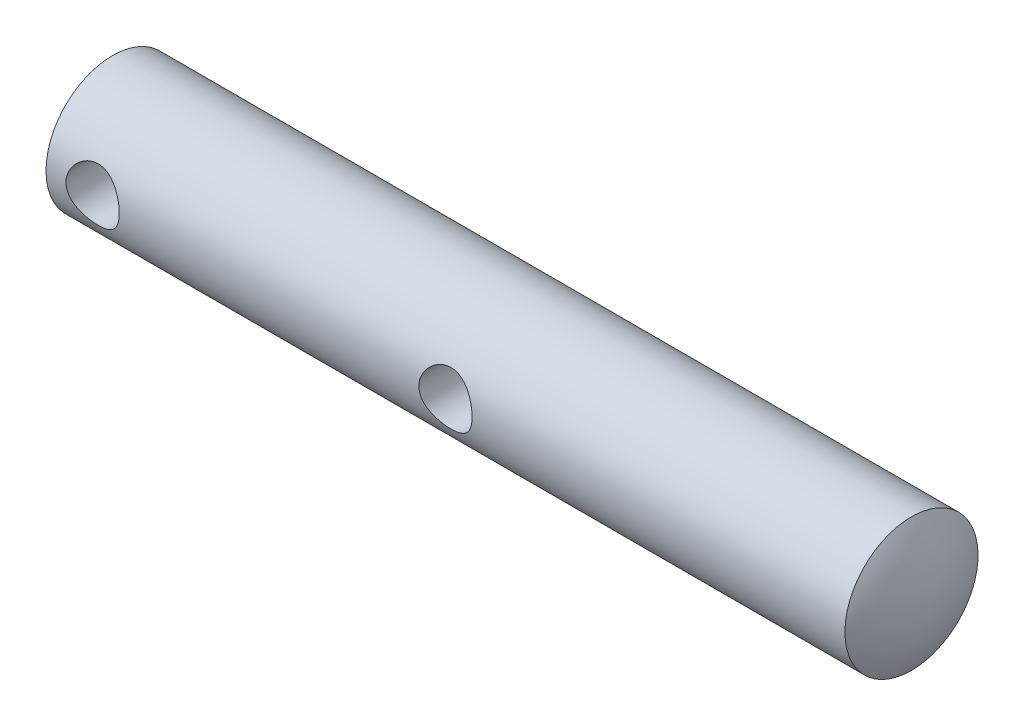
ISO-10303-21;
HEADER;
FILE_DESCRIPTION(('STEP AP214'),'2;1');
FILE_NAME('part.step','',(''),(''),'','','');
FILE_SCHEMA(('AUTOMOTIVE_DESIGN { 1 0 10303 214 1 1 1 1 }'));
ENDSEC;
DATA;
#1=APPLICATION_CONTEXT('core data for automotive mechanical design processes');
#2=APPLICATION_PROTOCOL_DEFINITION('international standard','automotive_design',2000,#1);
#3=PRODUCT_CONTEXT('',#1,'mechanical');
#4=PRODUCT('Part','Part','',(#3));
#5=PRODUCT_RELATED_PRODUCT_CATEGORY('part','',(#4));
#6=PRODUCT_DEFINITION_FORMATION('','',#4);
#7=PRODUCT_DEFINITION_CONTEXT('part definition',#1,'design');
#8=PRODUCT_DEFINITION('design','',#6,#7);
#9=PRODUCT_DEFINITION_SHAPE('','',#8);
#10=(LENGTH_UNIT() NAMED_UNIT(*) SI_UNIT(.MILLI.,.METRE.));
#11=(NAMED_UNIT(*) PLANE_ANGLE_UNIT() SI_UNIT($,.RADIAN.));
#12=(NAMED_UNIT(*) SI_UNIT($,.STERADIAN.) SOLID_ANGLE_UNIT());
#13=UNCERTAINTY_MEASURE_WITH_UNIT(LENGTH_MEASURE(1.E-05),#10,'distance_accuracy_value','');
#14=(GEOMETRIC_REPRESENTATION_CONTEXT(3) GLOBAL_UNCERTAINTY_ASSIGNED_CONTEXT((#13)) GLOBAL_UNIT_ASSIGNED_CONTEXT((#10,
#11,#12)) REPRESENTATION_CONTEXT('',''));
#15=CARTESIAN_POINT('',(0.,0.,0.));
#16=DIRECTION('',(0.,0.,1.));
#17=DIRECTION('',(1.,0.,0.));
#18=AXIS2_PLACEMENT_3D('',#15,#16,#17);
#19=CARTESIAN_POINT('',(52.861541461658,0.,0.));
#20=DIRECTION('',(-1.,0.,0.));
#21=DIRECTION('',(0.,-1.,0.));
#22=AXIS2_PLACEMENT_3D('',#19,#20,#21);
#23=SPHERICAL_SURFACE('',#22,9.86154146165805);
#24=CARTESIAN_POINT('',(61.361541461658,0.,0.));
#25=DIRECTION('',(-1.,0.,0.));
#26=DIRECTION('',(0.,0.,1.));
#27=AXIS2_PLACEMENT_3D('',#24,#25,#26);
#28=CIRCLE('',#27,5.);
#29=CARTESIAN_POINT('',(61.361541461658,0.,5.));
#30=VERTEX_POINT('',#29);
#31=EDGE_CURVE('E49',#30,#30,#28,.T.);
#32=ORIENTED_EDGE('',*,*,#31,.F.);
#33=EDGE_LOOP('',(#32));
#34=FACE_BOUND('',#33,.T.);
#35=ADVANCED_FACE('F14',(#34),#23,.T.);
#36=CARTESIAN_POINT('',(1.36154146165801,0.,0.));
#37=DIRECTION('',(-1.,0.,0.));
#38=DIRECTION('',(0.,0.,1.));
#39=AXIS2_PLACEMENT_3D('',#36,#37,#38);
#40=CYLINDRICAL_SURFACE('',#39,5.);
#41=CARTESIAN_POINT('',(33.361541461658,0.,5.));
#42=CARTESIAN_POINT('',(33.3615316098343,0.107493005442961,4.99999271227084));
#43=CARTESIAN_POINT('',(33.3528237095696,0.215172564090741,4.99649294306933));
#44=CARTESIAN_POINT('',(33.3182937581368,0.427496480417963,4.98283453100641));
#45=CARTESIAN_POINT('',(33.2924251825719,0.532131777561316,4.97265778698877));
#46=CARTESIAN_POINT('',(33.2246653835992,0.734953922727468,4.94674209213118));
#47=CARTESIAN_POINT('',(33.1828266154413,0.833160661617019,4.93102136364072));
#48=CARTESIAN_POINT('',(33.0845222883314,1.02107197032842,4.89556610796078));
#49=CARTESIAN_POINT('',(33.0280618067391,1.11077947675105,4.87583297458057));
#50=CARTESIAN_POINT('',(32.899305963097,1.28350100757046,4.83330886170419));
#51=CARTESIAN_POINT('',(32.8264348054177,1.36606227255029,4.81042296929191));
#52=CARTESIAN_POINT('',(32.6681414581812,1.51817500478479,4.76460576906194));
#53=CARTESIAN_POINT('',(32.5827131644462,1.58772010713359,4.74167444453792));
#54=CARTESIAN_POINT('',(32.3971133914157,1.71487456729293,4.69722791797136));
#55=CARTESIAN_POINT('',(32.2964549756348,1.77181498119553,4.67582115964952));
#56=CARTESIAN_POINT('',(32.086005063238,1.86775471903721,4.63833647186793));
#57=CARTESIAN_POINT('',(31.9762179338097,1.90676256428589,4.62225601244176));
#58=CARTESIAN_POINT('',(31.7558291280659,1.96389882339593,4.59826357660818));
#59=CARTESIAN_POINT('',(31.6454902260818,1.98289396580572,4.59001420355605));
#60=CARTESIAN_POINT('',(31.4229064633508,2.00217296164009,4.58164004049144));
#61=CARTESIAN_POINT('',(31.310662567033,2.00246601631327,4.58151125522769));
#62=CARTESIAN_POINT('',(31.0957847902,1.9849893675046,4.58910500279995));
#63=CARTESIAN_POINT('',(30.993025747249,1.96847531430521,4.5962817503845));
#64=CARTESIAN_POINT('',(30.7918819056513,1.91994688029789,4.61676187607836));
#65=CARTESIAN_POINT('',(30.6934978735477,1.88792979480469,4.63006632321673));
#66=CARTESIAN_POINT('',(30.501523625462,1.80869473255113,4.6615948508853));
#67=CARTESIAN_POINT('',(30.4080722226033,1.76117986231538,4.67991379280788));
#68=CARTESIAN_POINT('',(30.2301256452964,1.65250646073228,4.7193811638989));
#69=CARTESIAN_POINT('',(30.1456338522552,1.5913428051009,4.74053065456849));
#70=CARTESIAN_POINT('',(29.981131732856,1.4515505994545,4.78526736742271));
#71=CARTESIAN_POINT('',(29.901972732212,1.37193746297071,4.80891664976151));
#72=CARTESIAN_POINT('',(29.757856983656,1.20031442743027,4.85459824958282));
#73=CARTESIAN_POINT('',(29.6929030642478,1.10830206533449,4.87663024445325));
#74=CARTESIAN_POINT('',(29.5779240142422,0.912077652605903,4.91714681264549));
#75=CARTESIAN_POINT('',(29.528219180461,0.807660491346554,4.93555270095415));
#76=CARTESIAN_POINT('',(29.4473736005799,0.591023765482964,4.96614828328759));
#77=CARTESIAN_POINT('',(29.4162234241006,0.478808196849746,4.97834113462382));
#78=CARTESIAN_POINT('',(29.3750931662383,0.256895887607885,4.9945613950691));
#79=CARTESIAN_POINT('',(29.3639690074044,0.147443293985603,4.99902945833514));
#80=CARTESIAN_POINT('',(29.3598283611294,-0.0718453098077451,5.00068478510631));
#81=CARTESIAN_POINT('',(29.3668071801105,-0.181681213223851,4.99787393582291));
#82=CARTESIAN_POINT('',(29.39783321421,-0.39343273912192,4.98557567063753));
#83=CARTESIAN_POINT('',(29.421099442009,-0.495482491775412,4.97639391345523));
#84=CARTESIAN_POINT('',(29.4829771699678,-0.694135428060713,4.952594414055));
#85=CARTESIAN_POINT('',(29.5215906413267,-0.790737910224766,4.93797597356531));
#86=CARTESIAN_POINT('',(29.614326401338,-0.97907878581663,4.90416594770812));
#87=CARTESIAN_POINT('',(29.6688869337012,-1.07057802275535,4.88484815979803));
#88=CARTESIAN_POINT('',(29.7914817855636,-1.2434435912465,4.84373364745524));
#89=CARTESIAN_POINT('',(29.8595215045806,-1.32480584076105,4.82193593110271));
#90=CARTESIAN_POINT('',(30.0124114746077,-1.48072304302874,4.77645117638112));
#91=CARTESIAN_POINT('',(30.0980750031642,-1.55447393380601,4.75273441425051));
#92=CARTESIAN_POINT('',(30.2809815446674,-1.68675119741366,4.70741672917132));
#93=CARTESIAN_POINT('',(30.378226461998,-1.74527506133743,4.68581615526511));
#94=CARTESIAN_POINT('',(30.5830031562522,-1.84580750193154,4.64714299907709));
#95=CARTESIAN_POINT('',(30.6906254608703,-1.88765059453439,4.63011630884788));
#96=CARTESIAN_POINT('',(30.9122751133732,-1.95229621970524,4.60323673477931));
#97=CARTESIAN_POINT('',(31.0262976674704,-1.97511280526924,4.59337855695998));
#98=CARTESIAN_POINT('',(31.2486693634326,-1.99971561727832,4.58271759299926));
#99=CARTESIAN_POINT('',(31.3568363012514,-2.0028970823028,4.58131421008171));
#100=CARTESIAN_POINT('',(31.5720863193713,-1.99180315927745,4.58614836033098));
#101=CARTESIAN_POINT('',(31.6791695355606,-1.9775299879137,4.59238492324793));
#102=CARTESIAN_POINT('',(31.8848736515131,-1.93307136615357,4.61126649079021));
#103=CARTESIAN_POINT('',(31.983661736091,-1.9035374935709,4.62364831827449));
#104=CARTESIAN_POINT('',(32.1749200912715,-1.83000544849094,4.65324001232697));
#105=CARTESIAN_POINT('',(32.2673886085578,-1.78600328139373,4.67045121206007));
#106=CARTESIAN_POINT('',(32.4491510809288,-1.68187276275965,4.70898609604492));
#107=CARTESIAN_POINT('',(32.5379601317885,-1.62096533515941,4.73048882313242));
#108=CARTESIAN_POINT('',(32.7045347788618,-1.48589211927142,4.77463804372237));
#109=CARTESIAN_POINT('',(32.7822970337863,-1.41172233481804,4.79728488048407));
#110=CARTESIAN_POINT('',(32.9297443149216,-1.24650550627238,4.84293567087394));
#111=CARTESIAN_POINT('',(32.9985787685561,-1.15467600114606,4.86586757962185));
#112=CARTESIAN_POINT('',(33.1198785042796,-0.959900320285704,4.90800406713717));
#113=CARTESIAN_POINT('',(33.1723361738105,-0.85694900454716,4.92720691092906));
#114=CARTESIAN_POINT('',(33.2581636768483,-0.644738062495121,4.95939714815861));
#115=CARTESIAN_POINT('',(33.2918707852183,-0.535631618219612,4.97249363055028));
#116=CARTESIAN_POINT('',(33.3401805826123,-0.312876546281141,4.99144306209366));
#117=CARTESIAN_POINT('',(33.3548438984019,-0.199243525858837,4.99731899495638));
#118=CARTESIAN_POINT('',(33.3609368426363,-0.0569122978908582,4.99975899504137));
#119=CARTESIAN_POINT('',(33.3615440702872,-0.0284626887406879,5.00000192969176));
#120=CARTESIAN_POINT('',(33.361541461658,0.,5.));
#121=B_SPLINE_CURVE_WITH_KNOTS('',3,(#41,#42,#43,#44,#45,#46,#47,#48,#49,#50,#51,#52,#53,#54,
#55,#56,#57,#58,#59,#60,#61,#62,#63,#64,#65,#66,#67,#68,#69,#70,#71,#72,#73,#74,#75,#76,#77,#78,
#79,#80,#81,#82,#83,#84,#85,#86,#87,#88,#89,#90,#91,#92,#93,#94,#95,#96,#97,#98,#99,#100,#101,
#102,#103,#104,#105,#106,#107,#108,#109,#110,#111,#112,#113,#114,#115,#116,#117,#118,#119,#120),
.UNSPECIFIED.,.T.,.F.,(4,2,2,2,2,2,2,2,2,2,2,2,2,2,2,2,2,2,2,2,2,2,2,2,2,2,2,2,2,2,2,2,2,2,2,2,
2,2,2,4),(0.,0.322402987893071,0.645683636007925,0.967911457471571,1.29002753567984,
1.62597381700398,1.96208394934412,2.31315258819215,2.66405423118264,2.99904105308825,
3.33386306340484,3.6453832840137,3.95695787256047,4.27489126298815,4.59294421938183,
4.93558349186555,5.2782909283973,5.62776913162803,5.97706956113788,6.30569184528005,
6.6342289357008,6.94800455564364,7.26182048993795,7.58523513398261,7.90877959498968,
8.25368474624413,8.59864669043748,8.94695045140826,9.29499672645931,9.61799673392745,
9.94095572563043,10.2511431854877,10.5614163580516,10.8894546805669,11.2175920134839,
11.5670042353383,11.9165786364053,12.2596430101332,12.6016125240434,12.6869804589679),.UNSPECIFIED.);
#122=CARTESIAN_POINT('',(33.361541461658,0.,5.));
#123=VERTEX_POINT('',#122);
#124=EDGE_CURVE('E9',#123,#123,#121,.T.);
#125=ORIENTED_EDGE('',*,*,#124,.F.);
#126=EDGE_LOOP('',(#125));
#127=FACE_BOUND('',#126,.T.);
#128=CARTESIAN_POINT('',(6.861541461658,0.,5.));
#129=CARTESIAN_POINT('',(6.86153160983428,0.10749300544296,4.99999271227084));
#130=CARTESIAN_POINT('',(6.85282370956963,0.215172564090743,4.99649294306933));
#131=CARTESIAN_POINT('',(6.81829375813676,0.427496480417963,4.98283453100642));
#132=CARTESIAN_POINT('',(6.79242518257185,0.532131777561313,4.97265778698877));
#133=CARTESIAN_POINT('',(6.72466538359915,0.734953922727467,4.94674209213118));
#134=CARTESIAN_POINT('',(6.68282661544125,0.833160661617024,4.93102136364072));
#135=CARTESIAN_POINT('',(6.58452228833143,1.02107197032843,4.89556610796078));
#136=CARTESIAN_POINT('',(6.52806180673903,1.11077947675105,4.87583297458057));
#137=CARTESIAN_POINT('',(6.39930596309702,1.28350100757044,4.83330886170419));
#138=CARTESIAN_POINT('',(6.3264348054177,1.36606227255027,4.81042296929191));
#139=CARTESIAN_POINT('',(6.16814145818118,1.51817500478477,4.76460576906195));
#140=CARTESIAN_POINT('',(6.0827131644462,1.58772010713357,4.74167444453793));
#141=CARTESIAN_POINT('',(5.89711339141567,1.71487456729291,4.69722791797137));
#142=CARTESIAN_POINT('',(5.79645497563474,1.77181498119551,4.67582115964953));
#143=CARTESIAN_POINT('',(5.5860050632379,1.86775471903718,4.63833647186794));
#144=CARTESIAN_POINT('',(5.47621793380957,1.90676256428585,4.62225601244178));
#145=CARTESIAN_POINT('',(5.25582912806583,1.96389882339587,4.59826357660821));
#146=CARTESIAN_POINT('',(5.14549022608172,1.98289396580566,4.59001420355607));
#147=CARTESIAN_POINT('',(4.92290646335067,2.00217296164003,4.58164004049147));
#148=CARTESIAN_POINT('',(4.81066256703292,2.00246601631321,4.58151125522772));
#149=CARTESIAN_POINT('',(4.5957847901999,1.98498936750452,4.58910500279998));
#150=CARTESIAN_POINT('',(4.49302574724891,1.96847531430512,4.59628175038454));
#151=CARTESIAN_POINT('',(4.29188190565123,1.9199468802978,4.6167618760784));
#152=CARTESIAN_POINT('',(4.19349787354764,1.8879297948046,4.63006632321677));
#153=CARTESIAN_POINT('',(4.00152362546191,1.80869473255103,4.66159485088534));
#154=CARTESIAN_POINT('',(3.90807222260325,1.76117986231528,4.67991379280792));
#155=CARTESIAN_POINT('',(3.73012564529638,1.65250646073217,4.71938116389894));
#156=CARTESIAN_POINT('',(3.64563385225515,1.59134280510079,4.74053065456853));
#157=CARTESIAN_POINT('',(3.48113173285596,1.45155059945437,4.78526736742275));
#158=CARTESIAN_POINT('',(3.40197273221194,1.37193746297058,4.80891664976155));
#159=CARTESIAN_POINT('',(3.25785698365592,1.20031442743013,4.85459824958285));
#160=CARTESIAN_POINT('',(3.19290306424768,1.10830206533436,4.87663024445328));
#161=CARTESIAN_POINT('',(3.07792401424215,0.912077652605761,4.91714681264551));
#162=CARTESIAN_POINT('',(3.02821918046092,0.8076604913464,4.93555270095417));
#163=CARTESIAN_POINT('',(2.94737360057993,0.591023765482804,4.96614828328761));
#164=CARTESIAN_POINT('',(2.91622342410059,0.478808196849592,4.97834113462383));
#165=CARTESIAN_POINT('',(2.87509316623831,0.256895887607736,4.99456139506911));
#166=CARTESIAN_POINT('',(2.86396900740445,0.147443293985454,4.99902945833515));
#167=CARTESIAN_POINT('',(2.8598283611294,-0.0718453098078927,5.00068478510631));
#168=CARTESIAN_POINT('',(2.86680718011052,-0.181681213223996,4.9978739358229));
#169=CARTESIAN_POINT('',(2.89783321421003,-0.393432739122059,4.98557567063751));
#170=CARTESIAN_POINT('',(2.921099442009,-0.495482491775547,4.97639391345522));
#171=CARTESIAN_POINT('',(2.98297716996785,-0.694135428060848,4.95259441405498));
#172=CARTESIAN_POINT('',(3.02159064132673,-0.790737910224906,4.93797597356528));
#173=CARTESIAN_POINT('',(3.11432640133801,-0.979078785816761,4.90416594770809));
#174=CARTESIAN_POINT('',(3.1688869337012,-1.07057802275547,4.88484815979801));
#175=CARTESIAN_POINT('',(3.2914817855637,-1.24344359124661,4.84373364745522));
#176=CARTESIAN_POINT('',(3.35952150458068,-1.32480584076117,4.82193593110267));
#177=CARTESIAN_POINT('',(3.5124114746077,-1.48072304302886,4.77645117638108));
#178=CARTESIAN_POINT('',(3.59807500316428,-1.55447393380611,4.75273441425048));
#179=CARTESIAN_POINT('',(3.78098154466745,-1.68675119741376,4.70741672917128));
#180=CARTESIAN_POINT('',(3.87822646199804,-1.74527506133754,4.68581615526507));
#181=CARTESIAN_POINT('',(4.0830031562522,-1.84580750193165,4.64714299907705));
#182=CARTESIAN_POINT('',(4.1906254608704,-1.88765059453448,4.63011630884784));
#183=CARTESIAN_POINT('',(4.41227511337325,-1.95229621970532,4.60323673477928));
#184=CARTESIAN_POINT('',(4.52629766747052,-1.97511280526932,4.59337855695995));
#185=CARTESIAN_POINT('',(4.74866936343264,-1.9997156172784,4.58271759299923));
#186=CARTESIAN_POINT('',(4.85683630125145,-2.00289708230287,4.58131421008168));
#187=CARTESIAN_POINT('',(5.07208631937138,-1.99180315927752,4.58614836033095));
#188=CARTESIAN_POINT('',(5.17916953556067,-1.97752998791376,4.59238492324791));
#189=CARTESIAN_POINT('',(5.38487365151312,-1.93307136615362,4.61126649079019));
#190=CARTESIAN_POINT('',(5.48366173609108,-1.90353749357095,4.62364831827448));
#191=CARTESIAN_POINT('',(5.67492009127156,-1.83000544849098,4.65324001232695));
#192=CARTESIAN_POINT('',(5.7673886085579,-1.78600328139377,4.67045121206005));
#193=CARTESIAN_POINT('',(5.94915108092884,-1.68187276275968,4.7089860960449));
#194=CARTESIAN_POINT('',(6.03796013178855,-1.62096533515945,4.73048882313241));
#195=CARTESIAN_POINT('',(6.20453477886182,-1.48589211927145,4.77463804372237));
#196=CARTESIAN_POINT('',(6.28229703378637,-1.41172233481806,4.79728488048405));
#197=CARTESIAN_POINT('',(6.42974431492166,-1.2465055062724,4.84293567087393));
#198=CARTESIAN_POINT('',(6.49857876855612,-1.15467600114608,4.86586757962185));
#199=CARTESIAN_POINT('',(6.61987850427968,-0.959900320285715,4.90800406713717));
#200=CARTESIAN_POINT('',(6.67233617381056,-0.856949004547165,4.92720691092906));
#201=CARTESIAN_POINT('',(6.75816367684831,-0.644738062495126,4.95939714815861));
#202=CARTESIAN_POINT('',(6.79187078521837,-0.535631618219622,4.97249363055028));
#203=CARTESIAN_POINT('',(6.84018058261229,-0.312876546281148,4.99144306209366));
#204=CARTESIAN_POINT('',(6.8548438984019,-0.199243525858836,4.99731899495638));
#205=CARTESIAN_POINT('',(6.86093684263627,-0.0569122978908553,4.99975899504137));
#206=CARTESIAN_POINT('',(6.8615440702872,-0.0284626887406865,5.00000192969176));
#207=CARTESIAN_POINT('',(6.861541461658,0.,5.));
#208=B_SPLINE_CURVE_WITH_KNOTS('',3,(#128,#129,#130,#131,#132,#133,#134,#135,#136,#137,#138,
#139,#140,#141,#142,#143,#144,#145,#146,#147,#148,#149,#150,#151,#152,#153,#154,#155,#156,#157,
#158,#159,#160,#161,#162,#163,#164,#165,#166,#167,#168,#169,#170,#171,#172,#173,#174,#175,#176,
#177,#178,#179,#180,#181,#182,#183,#184,#185,#186,#187,#188,#189,#190,#191,#192,#193,#194,#195,
#196,#197,#198,#199,#200,#201,#202,#203,#204,#205,#206,#207),.UNSPECIFIED.,.T.,.F.,(4,2,2,2,2,2,
2,2,2,2,2,2,2,2,2,2,2,2,2,2,2,2,2,2,2,2,2,2,2,2,2,2,2,2,2,2,2,2,2,4),(0.,0.32240298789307,
0.645683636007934,0.96791145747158,1.29002753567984,1.62597381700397,1.96208394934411,
2.31315258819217,2.66405423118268,2.99904105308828,3.33386306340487,3.64538328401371,
3.95695787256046,4.27489126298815,4.59294421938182,4.93558349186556,5.27829092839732,
5.62776913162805,5.97706956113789,6.30569184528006,6.6342289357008,6.94800455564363,
7.26182048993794,7.5852351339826,7.90877959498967,8.25368474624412,8.59864669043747,
8.94695045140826,9.29499672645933,9.61799673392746,9.94095572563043,10.2511431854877,
10.5614163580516,10.8894546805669,11.2175920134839,11.5670042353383,11.9165786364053,
12.2596430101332,12.6016125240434,12.6869804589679),.UNSPECIFIED.);
#209=CARTESIAN_POINT('',(6.861541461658,0.,5.));
#210=VERTEX_POINT('',#209);
#211=EDGE_CURVE('E25',#210,#210,#208,.T.);
#212=ORIENTED_EDGE('',*,*,#211,.F.);
#213=EDGE_LOOP('',(#212));
#214=FACE_BOUND('',#213,.T.);
#215=ORIENTED_EDGE('',*,*,#31,.T.);
#216=EDGE_LOOP('',(#215));
#217=FACE_BOUND('',#216,.T.);
#218=CARTESIAN_POINT('',(1.36154146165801,0.,0.));
#219=DIRECTION('',(-1.,0.,0.));
#220=DIRECTION('',(0.,0.,1.));
#221=AXIS2_PLACEMENT_3D('',#218,#219,#220);
#222=CIRCLE('',#221,5.);
#223=CARTESIAN_POINT('',(1.36154146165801,0.,5.));
#224=VERTEX_POINT('',#223);
#225=EDGE_CURVE('E44',#224,#224,#222,.T.);
#226=ORIENTED_EDGE('',*,*,#225,.F.);
#227=EDGE_LOOP('',(#226));
#228=FACE_BOUND('',#227,.T.);
#229=ADVANCED_FACE('F56',(#127,#214,#217,#228),#40,.T.);
#230=CARTESIAN_POINT('',(9.86154146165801,0.,0.));
#231=DIRECTION('',(-1.,0.,0.));
#232=DIRECTION('',(0.,1.,0.));
#233=AXIS2_PLACEMENT_3D('',#230,#231,#232);
#234=SPHERICAL_SURFACE('',#233,9.86154146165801);
#235=ORIENTED_EDGE('',*,*,#225,.T.);
#236=EDGE_LOOP('',(#235));
#237=FACE_BOUND('',#236,.T.);
#238=ADVANCED_FACE('F65',(#237),#234,.T.);
#239=CARTESIAN_POINT('',(4.86154146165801,0.,-3.));
#240=DIRECTION('',(0.,0.,1.));
#241=DIRECTION('',(1.,0.,0.));
#242=AXIS2_PLACEMENT_3D('',#239,#240,#241);
#243=CONICAL_SURFACE('',#242,2.,1.02974425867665);
#244=CARTESIAN_POINT('',(4.86154146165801,0.,-4.20172123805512));
#245=VERTEX_POINT('',#244);
#246=VERTEX_LOOP('',#245);
#247=FACE_BOUND('',#246,.T.);
#248=CARTESIAN_POINT('',(4.86154146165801,0.,-3.));
#249=DIRECTION('',(0.,0.,1.));
#250=DIRECTION('',(1.,0.,0.));
#251=AXIS2_PLACEMENT_3D('',#248,#249,#250);
#252=CIRCLE('',#251,2.);
#253=CARTESIAN_POINT('',(6.86154146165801,0.,-3.));
#254=VERTEX_POINT('',#253);
#255=EDGE_CURVE('E41',#254,#254,#252,.T.);
#256=ORIENTED_EDGE('',*,*,#255,.T.);
#257=EDGE_LOOP('',(#256));
#258=FACE_BOUND('',#257,.T.);
#259=ADVANCED_FACE('F62',(#247,#258),#243,.F.);
#260=CARTESIAN_POINT('',(4.86154146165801,0.,5.));
#261=DIRECTION('',(0.,0.,1.));
#262=DIRECTION('',(1.,0.,0.));
#263=AXIS2_PLACEMENT_3D('',#260,#261,#262);
#264=CYLINDRICAL_SURFACE('',#263,2.);
#265=ORIENTED_EDGE('',*,*,#211,.T.);
#266=EDGE_LOOP('',(#265));
#267=FACE_BOUND('',#266,.T.);
#268=ORIENTED_EDGE('',*,*,#255,.F.);
#269=EDGE_LOOP('',(#268));
#270=FACE_BOUND('',#269,.T.);
#271=ADVANCED_FACE('F35',(#267,#270),#264,.F.);
#272=CARTESIAN_POINT('',(31.361541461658,0.,-3.));
#273=DIRECTION('',(0.,0.,1.));
#274=DIRECTION('',(1.,0.,0.));
#275=AXIS2_PLACEMENT_3D('',#272,#273,#274);
#276=CONICAL_SURFACE('',#275,2.,1.02974425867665);
#277=CARTESIAN_POINT('',(31.361541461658,0.,-4.20172123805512));
#278=VERTEX_POINT('',#277);
#279=VERTEX_LOOP('',#278);
#280=FACE_BOUND('',#279,.T.);
#281=CARTESIAN_POINT('',(31.361541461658,0.,-3.));
#282=DIRECTION('',(0.,0.,1.));
#283=DIRECTION('',(1.,0.,0.));
#284=AXIS2_PLACEMENT_3D('',#281,#282,#283);
#285=CIRCLE('',#284,2.);
#286=CARTESIAN_POINT('',(33.361541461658,0.,-3.));
#287=VERTEX_POINT('',#286);
#288=EDGE_CURVE('E39',#287,#287,#285,.T.);
#289=ORIENTED_EDGE('',*,*,#288,.T.);
#290=EDGE_LOOP('',(#289));
#291=FACE_BOUND('',#290,.T.);
#292=ADVANCED_FACE('F31',(#280,#291),#276,.F.);
#293=CARTESIAN_POINT('',(31.361541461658,0.,5.));
#294=DIRECTION('',(0.,0.,1.));
#295=DIRECTION('',(1.,0.,0.));
#296=AXIS2_PLACEMENT_3D('',#293,#294,#295);
#297=CYLINDRICAL_SURFACE('',#296,2.);
#298=ORIENTED_EDGE('',*,*,#124,.T.);
#299=EDGE_LOOP('',(#298));
#300=FACE_BOUND('',#299,.T.);
#301=ORIENTED_EDGE('',*,*,#288,.F.);
#302=EDGE_LOOP('',(#301));
#303=FACE_BOUND('',#302,.T.);
#304=ADVANCED_FACE('F34',(#300,#303),#297,.F.);
#305=CLOSED_SHELL('',(#35,#229,#238,#259,#271,#292,#304));
#306=MANIFOLD_SOLID_BREP('B1',#305);
#307=ADVANCED_BREP_SHAPE_REPRESENTATION('',(#18,#306),#14);
#308=SHAPE_DEFINITION_REPRESENTATION(#9,#307);
ENDSEC;
END-ISO-10303-21;
